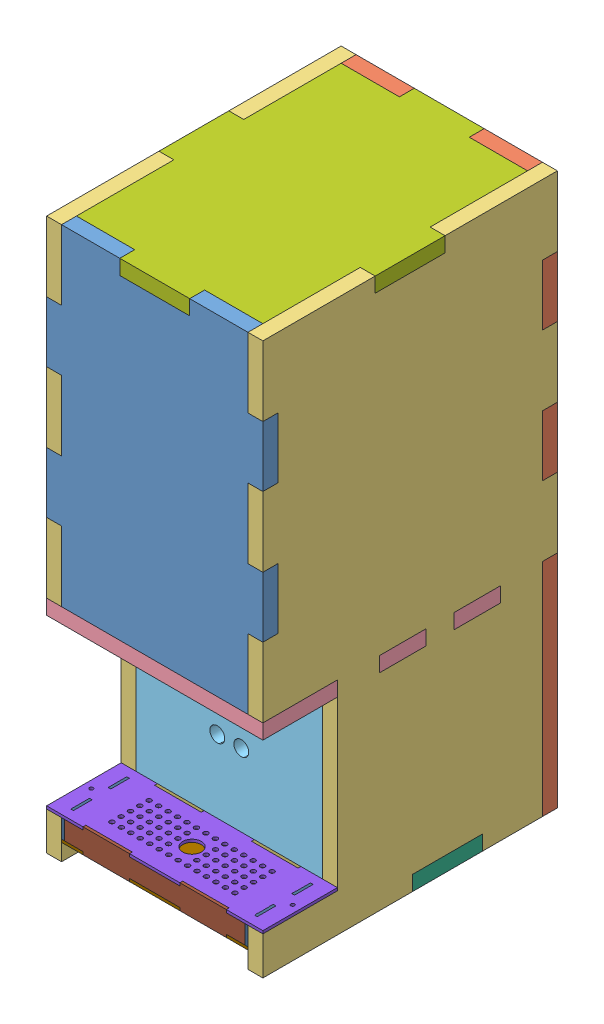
SolidWorks assembly Assem.v2.SLDASM, configuration Default (file format 9000). Lengths in mm.
Overall size (232 592 316).
16 component instances, 13 part files, 24 mates.
Components (placement in the parent):
- Part1-1: Part1.SLDPRT [Default] at (-783.3262 -65.3384 347) size (232 355 16)
- Part2-1: Part2.SLDPRT [Default] at (-771.3262 -245.3384 47) size (232 592 16)
- Part3-1: Part3.SLDPRT [Default] at (-567.3262 -245.3384 267) x (0 0 -1) z (1 0 0) size (316 592 16)
- Part4-1: Part4.SLDPRT [Default] at (-567.3262 -81.3384 363) x (-1 0 0) z (0 -1 0) size (232 316 16)
- Part5-1: Part5.SLDPRT [Default] at (-767.3262 -302.3384 267) size (200 237 16)
- Part6-1: Part6.SLDPRT [Default] at (-767.3262 -286.3384 63) x (1 0 0) z (0 -1 0) size (232 236 16)
- Part7-1: Part7.SLDPRT [Default] at (-767.3262 289.6616 63) x (1 0 0) z (0 -1 0) size (232 316 16)
- Part3-2: Part3.SLDPRT [Default] at (-783.3262 -245.3384 267) x (0 0 -1) z (1 0 0) size (316 592 16)
- stand-1: stand.SLDASM [Default] at (-722.0574 -336.1395 595.5883) x (-1 0 0) z (0 0 -1) size (232 26 106.75)
  - dispenser_stand-1: dispenser_stand.SLDPRT [Default] at (-170.7312 77.8011 232.5883) size (232 3 80)
  - dispenser_stand.p2-1: dispenser_stand.p2.SLDPRT [Default] at (-154.7312 54.8011 232.5883) size (200 3 80)
  - dispenser_stand.p3-1: dispenser_stand.p3.SLDPRT [Default] at (-154.7312 54.8011 312.5883) x (0 0 -1) z (1 0 0) size (80 26 3)
  - dispenser_stand.p3-2: dispenser_stand.p3.SLDPRT [Default] at (42.2688 54.8011 312.5883) x (0 0 -1) z (1 0 0) size (80 26 3)
  - dispenser_stand.p4-2: dispenser_stand.p4.SLDPRT [Default] at (-151.7312 54.8011 232.5883) size (194 26 3)
  - dispenser_stand.p5-2: dispenser_stand.p5.SLDPRT [Default] at (42.4688 54.8011 312.5883) x (-1 0 0) z (0 0 -1) size (194 26 3)
  - cylinder_dispenser-1: cylinder_dispenser.SLDPRT [Default] at (-123.5312 60.8011 309.3379) x (0.97573 0.218977 0) z (0 0 1) size (10 10 30)
Mates (geometry in assembly coordinates):
- Coincident23: coincident aligned: plane of Part2-1 through (-551.3262 9.6619 63) normal (1 0 0); plane of Part3-1 through (-551.3262 -245.3384 267) normal (1 0 0)
- Coincident24: coincident: plane of Part2-1 through (-567.3262 289.6616 63) normal (0 1 0); line of Part3-1 through (-567.3262 289.6616 242.5) axis (0 0 1)
- Coincident25: coincident aligned: plane of Part2-1 through (-771.3262 -245.3384 47) normal (0 0 -1); plane of Part3-1 through (-551.3262 -245.3384 47) normal (0 0 -1)
- Coincident27: coincident aligned: plane of Part2-1 through (-704.8262 289.6616 63) normal (0 1 0); plane of Part3-2 through (-767.3262 289.6616 267) normal (0 1 0)
- Coincident29: coincident aligned: plane of Part2-1 through (-783.3262 149.6616 63) normal (-1 0 0); plane of Part3-2 through (-783.3262 -245.3384 267) normal (-1 0 0)
- Coincident30: coincident aligned: plane of Part2-1 through (-771.3262 -245.3384 47) normal (0 0 -1); plane of Part3-2 through (-767.3262 -245.3384 47) normal (0 0 -1)
- Coincident31: coincident aligned: plane of Part2-1 through (-771.3262 -245.3384 47) normal (0 0 -1); plane of Part4-1 through (-567.3262 -65.3384 47) normal (0 0 -1)
- Coincident32: coincident anti-aligned: plane of Part2-1 through (-771.3262 -65.3384 63) normal (0 -1 0); plane of Part4-1 through (-567.3262 -65.3384 363) normal (0 1 0)
- Coincident33: coincident anti-aligned: plane of Part2-1 through (-597.3262 -245.3384 63) normal (-1 0 0); plane of Part4-1 through (-597.3262 -65.3384 363) normal (1 0 0)
- Coincident34: coincident aligned: plane of Part4-1 through (-567.3262 -65.3384 363) normal (0 1 0); plane of Part5-1 through (-767.3262 -65.3384 283) normal (0 1 0)
- Coincident35: coincident anti-aligned: plane of Part4-1 through (-567.3262 -65.3384 283) normal (0 0 -1); plane of Part5-1 through (-767.3262 -302.3384 283) normal (0 0 1)
- Coincident36: coincident anti-aligned: plane of Part4-1 through (-567.3262 -65.3384 283) normal (0 0 -1); plane of Part5-1 through (-767.3262 -302.3384 283) normal (0 0 1)
- Coincident37: coincident anti-aligned: plane of Part4-1 through (-597.3262 -65.3384 363) normal (-1 0 0); plane of Part5-1 through (-597.3262 -302.3384 283) normal (1 0 0)
- Coincident38: coincident aligned: plane of Part1-1 through (-783.3262 289.6616 363) normal (0 1 0); plane of Part3-2 through (-767.3262 289.6616 267) normal (0 1 0)
- Coincident39: coincident aligned: plane of Part1-1 through (-783.3262 -65.3384 363) normal (0 0 1); plane of Part3-2 through (-767.3262 -245.3384 363) normal (0 0 1)
- Coincident40: coincident aligned: plane of Part1-1 through (-783.3262 -65.3384 363) normal (-1 0 0); plane of Part3-2 through (-783.3262 -245.3384 267) normal (-1 0 0)
- Coincident41: coincident aligned: plane of Part3-1 through (-551.3262 289.6616 267) normal (0 1 0); plane of Part7-1 through (-767.3262 289.6616 63) normal (0 1 0)
- Coincident42: coincident aligned: plane of Part3-1 through (-551.3262 -245.3384 267) normal (1 0 0); plane of Part7-1 through (-551.3262 273.6616 63) normal (1 0 0)
- Coincident43: coincident anti-aligned: plane of Part3-1 through (-551.3262 -245.3384 167.5) normal (0 0 1); plane of Part7-1 through (-767.3262 273.6616 167.5) normal (0 0 -1)
- Coincident44: coincident aligned: plane of Part3-1 through (-551.3262 -302.3384 267) normal (0 -1 0); plane of Part6-1 through (-767.3262 -302.3384 63) normal (0 -1 0)
- Coincident45: coincident aligned: plane of Part3-1 through (-551.3262 -245.3384 267) normal (1 0 0); plane of Part6-1 through (-551.3262 -302.3384 63) normal (1 0 0)
- Coincident46: coincident anti-aligned: plane of Part3-1 through (-551.3262 -245.3384 202.5) normal (0 0 -1); plane of Part6-1 through (-767.3262 -302.3384 202.5) normal (0 0 1)
- Coincident47: coincident anti-aligned: plane of Part3-1 through (-551.3262 -261.3384 267) normal (0 1 0); plane of stand-1/dispenser_stand-1 through (-551.3262 -261.3384 283) normal (0 -1 0)
- Coincident48: coincident aligned: plane of Part3-1 through (-551.3262 -245.3384 267) normal (1 0 0); plane of stand-1/dispenser_stand-1 through (-551.3262 -261.3384 283) normal (1 0 0)
